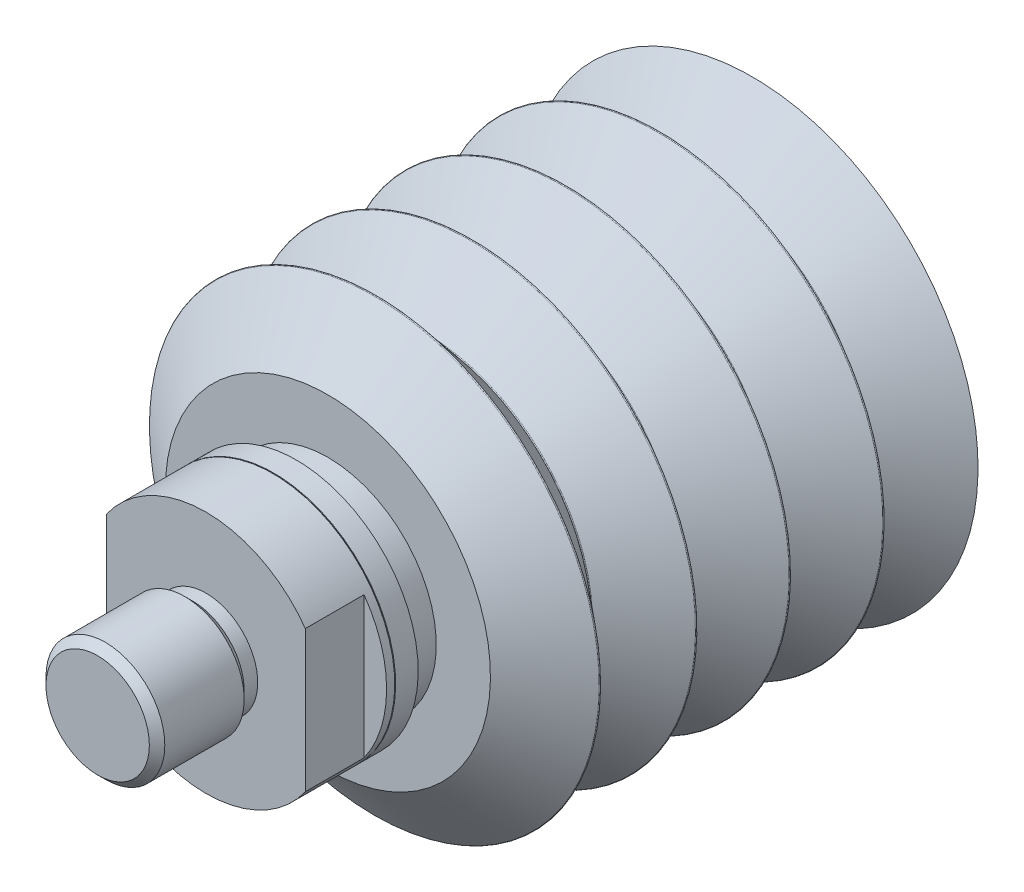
ISO-10303-21;
HEADER;
FILE_DESCRIPTION(('STEP AP214'),'2;1');
FILE_NAME('part.step','',(''),(''),'','','');
FILE_SCHEMA(('AUTOMOTIVE_DESIGN { 1 0 10303 214 1 1 1 1 }'));
ENDSEC;
DATA;
#1=APPLICATION_CONTEXT('core data for automotive mechanical design processes');
#2=APPLICATION_PROTOCOL_DEFINITION('international standard','automotive_design',2000,#1);
#3=PRODUCT_CONTEXT('',#1,'mechanical');
#4=PRODUCT('Part','Part','',(#3));
#5=PRODUCT_RELATED_PRODUCT_CATEGORY('part','',(#4));
#6=PRODUCT_DEFINITION_FORMATION('','',#4);
#7=PRODUCT_DEFINITION_CONTEXT('part definition',#1,'design');
#8=PRODUCT_DEFINITION('design','',#6,#7);
#9=PRODUCT_DEFINITION_SHAPE('','',#8);
#10=(LENGTH_UNIT() NAMED_UNIT(*) SI_UNIT(.MILLI.,.METRE.));
#11=(NAMED_UNIT(*) PLANE_ANGLE_UNIT() SI_UNIT($,.RADIAN.));
#12=(NAMED_UNIT(*) SI_UNIT($,.STERADIAN.) SOLID_ANGLE_UNIT());
#13=UNCERTAINTY_MEASURE_WITH_UNIT(LENGTH_MEASURE(1.E-05),#10,'distance_accuracy_value','');
#14=(GEOMETRIC_REPRESENTATION_CONTEXT(3) GLOBAL_UNCERTAINTY_ASSIGNED_CONTEXT((#13)) GLOBAL_UNIT_ASSIGNED_CONTEXT((#10,
#11,#12)) REPRESENTATION_CONTEXT('',''));
#15=CARTESIAN_POINT('',(0.,0.,0.));
#16=DIRECTION('',(0.,0.,1.));
#17=DIRECTION('',(1.,0.,0.));
#18=AXIS2_PLACEMENT_3D('',#15,#16,#17);
#19=CARTESIAN_POINT('',(0.,0.,53.));
#20=DIRECTION('',(0.,0.,-1.));
#21=DIRECTION('',(0.,-1.,0.));
#22=AXIS2_PLACEMENT_3D('',#19,#20,#21);
#23=CYLINDRICAL_SURFACE('',#22,2.);
#24=CARTESIAN_POINT('',(0.,0.,53.));
#25=DIRECTION('',(0.,0.,-1.));
#26=DIRECTION('',(0.,-1.,0.));
#27=AXIS2_PLACEMENT_3D('',#24,#25,#26);
#28=CIRCLE('',#27,2.);
#29=CARTESIAN_POINT('',(0.,-2.,53.));
#30=VERTEX_POINT('',#29);
#31=EDGE_CURVE('E336',#30,#30,#28,.T.);
#32=ORIENTED_EDGE('',*,*,#31,.T.);
#33=EDGE_LOOP('',(#32));
#34=FACE_BOUND('',#33,.T.);
#35=CARTESIAN_POINT('',(0.,0.,60.5));
#36=DIRECTION('',(0.,0.,1.));
#37=DIRECTION('',(1.,0.,0.));
#38=AXIS2_PLACEMENT_3D('',#35,#36,#37);
#39=CIRCLE('',#38,2.);
#40=CARTESIAN_POINT('',(2.,0.,60.5));
#41=VERTEX_POINT('',#40);
#42=EDGE_CURVE('E439',#41,#41,#39,.F.);
#43=ORIENTED_EDGE('',*,*,#42,.F.);
#44=EDGE_LOOP('',(#43));
#45=FACE_BOUND('',#44,.T.);
#46=ADVANCED_FACE('F16',(#34,#45),#23,.F.);
#47=CARTESIAN_POINT('',(11.,-14.,61.5));
#48=DIRECTION('',(-1.,0.,0.));
#49=DIRECTION('',(0.,0.,1.));
#50=AXIS2_PLACEMENT_3D('',#47,#48,#49);
#51=PLANE('',#50);
#52=DIRECTION('',(0.,0.,1.));
#53=VECTOR('',#52,1.);
#54=CARTESIAN_POINT('',(11.,7.82623792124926,53.));
#55=LINE('',#54,#53);
#56=CARTESIAN_POINT('',(11.,7.82623792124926,54.));
#57=VERTEX_POINT('',#56);
#58=CARTESIAN_POINT('',(11.,7.82623792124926,60.5));
#59=VERTEX_POINT('',#58);
#60=EDGE_CURVE('E307',#57,#59,#55,.T.);
#61=ORIENTED_EDGE('',*,*,#60,.T.);
#62=DIRECTION('',(0.,-1.,0.));
#63=VECTOR('',#62,1.);
#64=CARTESIAN_POINT('',(11.,0.,60.5));
#65=LINE('',#64,#63);
#66=CARTESIAN_POINT('',(11.,-7.82623792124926,60.5));
#67=VERTEX_POINT('',#66);
#68=EDGE_CURVE('E40',#59,#67,#65,.T.);
#69=ORIENTED_EDGE('',*,*,#68,.T.);
#70=DIRECTION('',(0.,0.,-1.));
#71=VECTOR('',#70,1.);
#72=CARTESIAN_POINT('',(11.,-7.82623792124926,53.));
#73=LINE('',#72,#71);
#74=CARTESIAN_POINT('',(11.,-7.82623792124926,54.));
#75=VERTEX_POINT('',#74);
#76=EDGE_CURVE('E306',#67,#75,#73,.T.);
#77=ORIENTED_EDGE('',*,*,#76,.T.);
#78=DIRECTION('',(0.,1.,0.));
#79=VECTOR('',#78,1.);
#80=CARTESIAN_POINT('',(11.,-14.,54.));
#81=LINE('',#80,#79);
#82=EDGE_CURVE('E364',#75,#57,#81,.T.);
#83=ORIENTED_EDGE('',*,*,#82,.T.);
#84=EDGE_LOOP('',(#61,#69,#77,#83));
#85=FACE_BOUND('',#84,.T.);
#86=ADVANCED_FACE('F461',(#85),#51,.F.);
#87=CARTESIAN_POINT('',(0.,0.,54.));
#88=DIRECTION('',(0.,0.,1.));
#89=DIRECTION('',(-1.,0.,0.));
#90=AXIS2_PLACEMENT_3D('',#87,#88,#89);
#91=PLANE('',#90);
#92=ORIENTED_EDGE('',*,*,#82,.F.);
#93=CARTESIAN_POINT('',(0.,0.,54.));
#94=DIRECTION('',(0.,0.,-1.));
#95=DIRECTION('',(0.,1.,0.));
#96=AXIS2_PLACEMENT_3D('',#93,#94,#95);
#97=CIRCLE('',#96,13.5);
#98=EDGE_CURVE('E302',#57,#75,#97,.T.);
#99=ORIENTED_EDGE('',*,*,#98,.F.);
#100=EDGE_LOOP('',(#92,#99));
#101=FACE_BOUND('',#100,.T.);
#102=ADVANCED_FACE('F467',(#101),#91,.T.);
#103=CARTESIAN_POINT('',(0.,0.,54.));
#104=DIRECTION('',(0.,0.,1.));
#105=DIRECTION('',(-1.,0.,0.));
#106=AXIS2_PLACEMENT_3D('',#103,#104,#105);
#107=PLANE('',#106);
#108=DIRECTION('',(0.,-1.,0.));
#109=VECTOR('',#108,1.);
#110=CARTESIAN_POINT('',(-11.,14.,54.));
#111=LINE('',#110,#109);
#112=CARTESIAN_POINT('',(-11.,7.82623792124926,54.));
#113=VERTEX_POINT('',#112);
#114=CARTESIAN_POINT('',(-11.,-7.82623792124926,54.));
#115=VERTEX_POINT('',#114);
#116=EDGE_CURVE('E235',#113,#115,#111,.T.);
#117=ORIENTED_EDGE('',*,*,#116,.F.);
#118=CARTESIAN_POINT('',(0.,0.,54.));
#119=DIRECTION('',(0.,0.,-1.));
#120=DIRECTION('',(0.,1.,0.));
#121=AXIS2_PLACEMENT_3D('',#118,#119,#120);
#122=CIRCLE('',#121,13.5);
#123=EDGE_CURVE('E313',#115,#113,#122,.T.);
#124=ORIENTED_EDGE('',*,*,#123,.F.);
#125=EDGE_LOOP('',(#117,#124));
#126=FACE_BOUND('',#125,.T.);
#127=ADVANCED_FACE('F563',(#126),#107,.T.);
#128=CARTESIAN_POINT('',(-11.,14.,61.5));
#129=DIRECTION('',(1.,0.,0.));
#130=DIRECTION('',(0.,1.,0.));
#131=AXIS2_PLACEMENT_3D('',#128,#129,#130);
#132=PLANE('',#131);
#133=DIRECTION('',(0.,0.,1.));
#134=VECTOR('',#133,1.);
#135=CARTESIAN_POINT('',(-11.,-7.82623792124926,53.));
#136=LINE('',#135,#134);
#137=CARTESIAN_POINT('',(-11.,-7.82623792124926,60.5));
#138=VERTEX_POINT('',#137);
#139=EDGE_CURVE('E318',#115,#138,#136,.T.);
#140=ORIENTED_EDGE('',*,*,#139,.T.);
#141=DIRECTION('',(0.,1.,0.));
#142=VECTOR('',#141,1.);
#143=CARTESIAN_POINT('',(-11.,0.,60.5));
#144=LINE('',#143,#142);
#145=CARTESIAN_POINT('',(-11.,7.82623792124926,60.5));
#146=VERTEX_POINT('',#145);
#147=EDGE_CURVE('E224',#138,#146,#144,.T.);
#148=ORIENTED_EDGE('',*,*,#147,.T.);
#149=DIRECTION('',(0.,0.,-1.));
#150=VECTOR('',#149,1.);
#151=CARTESIAN_POINT('',(-11.,7.82623792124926,53.));
#152=LINE('',#151,#150);
#153=EDGE_CURVE('E317',#146,#113,#152,.T.);
#154=ORIENTED_EDGE('',*,*,#153,.T.);
#155=ORIENTED_EDGE('',*,*,#116,.T.);
#156=EDGE_LOOP('',(#140,#148,#154,#155));
#157=FACE_BOUND('',#156,.T.);
#158=ADVANCED_FACE('F542',(#157),#132,.F.);
#159=CARTESIAN_POINT('',(-13.5,0.,60.5));
#160=DIRECTION('',(0.,0.,1.));
#161=DIRECTION('',(-1.,0.,0.));
#162=AXIS2_PLACEMENT_3D('',#159,#160,#161);
#163=PLANE('',#162);
#164=CARTESIAN_POINT('',(0.,0.,60.5));
#165=DIRECTION('',(0.,0.,-1.));
#166=DIRECTION('',(-1.,0.,0.));
#167=AXIS2_PLACEMENT_3D('',#164,#165,#166);
#168=CIRCLE('',#167,5.725);
#169=CARTESIAN_POINT('',(-5.725,0.,60.5));
#170=VERTEX_POINT('',#169);
#171=EDGE_CURVE('E1309',#170,#170,#168,.T.);
#172=ORIENTED_EDGE('',*,*,#171,.T.);
#173=EDGE_LOOP('',(#172));
#174=FACE_BOUND('',#173,.T.);
#175=ORIENTED_EDGE('',*,*,#68,.F.);
#176=CARTESIAN_POINT('',(0.,0.,60.5));
#177=DIRECTION('',(0.,0.,-1.));
#178=DIRECTION('',(0.,-1.,0.));
#179=AXIS2_PLACEMENT_3D('',#176,#177,#178);
#180=CIRCLE('',#179,13.5);
#181=EDGE_CURVE('E382',#146,#59,#180,.T.);
#182=ORIENTED_EDGE('',*,*,#181,.F.);
#183=ORIENTED_EDGE('',*,*,#147,.F.);
#184=CARTESIAN_POINT('',(0.,0.,60.5));
#185=DIRECTION('',(0.,0.,-1.));
#186=DIRECTION('',(0.,-1.,0.));
#187=AXIS2_PLACEMENT_3D('',#184,#185,#186);
#188=CIRCLE('',#187,13.5);
#189=EDGE_CURVE('E343',#67,#138,#188,.T.);
#190=ORIENTED_EDGE('',*,*,#189,.F.);
#191=EDGE_LOOP('',(#175,#182,#183,#190));
#192=FACE_BOUND('',#191,.T.);
#193=ADVANCED_FACE('F538',(#174,#192),#163,.T.);
#194=CARTESIAN_POINT('',(0.,0.,53.));
#195=DIRECTION('',(0.,0.,-1.));
#196=DIRECTION('',(0.,-1.,0.));
#197=AXIS2_PLACEMENT_3D('',#194,#195,#196);
#198=CYLINDRICAL_SURFACE('',#197,13.5);
#199=CARTESIAN_POINT('',(0.,0.,53.1));
#200=DIRECTION('',(0.,0.,-1.));
#201=DIRECTION('',(0.,-1.,0.));
#202=AXIS2_PLACEMENT_3D('',#199,#200,#201);
#203=CIRCLE('',#202,13.5);
#204=CARTESIAN_POINT('',(0.,-13.5,53.1));
#205=VERTEX_POINT('',#204);
#206=EDGE_CURVE('E339',#205,#205,#203,.T.);
#207=ORIENTED_EDGE('',*,*,#206,.F.);
#208=EDGE_LOOP('',(#207));
#209=FACE_BOUND('',#208,.T.);
#210=ORIENTED_EDGE('',*,*,#139,.F.);
#211=ORIENTED_EDGE('',*,*,#123,.T.);
#212=ORIENTED_EDGE('',*,*,#153,.F.);
#213=ORIENTED_EDGE('',*,*,#181,.T.);
#214=ORIENTED_EDGE('',*,*,#60,.F.);
#215=ORIENTED_EDGE('',*,*,#98,.T.);
#216=ORIENTED_EDGE('',*,*,#76,.F.);
#217=ORIENTED_EDGE('',*,*,#189,.T.);
#218=EDGE_LOOP('',(#210,#211,#212,#213,#214,#215,#216,#217));
#219=FACE_BOUND('',#218,.T.);
#220=ADVANCED_FACE('F541',(#209,#219),#198,.T.);
#221=CARTESIAN_POINT('',(0.,0.,53.));
#222=DIRECTION('',(0.,0.,1.));
#223=DIRECTION('',(0.,1.,0.));
#224=AXIS2_PLACEMENT_3D('',#221,#222,#223);
#225=CONICAL_SURFACE('',#224,13.4,0.785398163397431);
#226=CARTESIAN_POINT('',(0.,0.,53.));
#227=DIRECTION('',(0.,0.,-1.));
#228=DIRECTION('',(0.,-1.,0.));
#229=AXIS2_PLACEMENT_3D('',#226,#227,#228);
#230=CIRCLE('',#229,13.4);
#231=CARTESIAN_POINT('',(0.,-13.4,53.));
#232=VERTEX_POINT('',#231);
#233=EDGE_CURVE('E377',#232,#232,#230,.T.);
#234=ORIENTED_EDGE('',*,*,#233,.F.);
#235=EDGE_LOOP('',(#234));
#236=FACE_BOUND('',#235,.T.);
#237=ORIENTED_EDGE('',*,*,#206,.T.);
#238=EDGE_LOOP('',(#237));
#239=FACE_BOUND('',#238,.T.);
#240=ADVANCED_FACE('F588',(#236,#239),#225,.T.);
#241=CARTESIAN_POINT('',(-2.,0.,53.));
#242=DIRECTION('',(0.,0.,-1.));
#243=DIRECTION('',(0.,-1.,0.));
#244=AXIS2_PLACEMENT_3D('',#241,#242,#243);
#245=PLANE('',#244);
#246=ORIENTED_EDGE('',*,*,#31,.F.);
#247=EDGE_LOOP('',(#246));
#248=FACE_BOUND('',#247,.T.);
#249=CARTESIAN_POINT('',(0.,0.,53.));
#250=DIRECTION('',(0.,0.,-1.));
#251=DIRECTION('',(0.,-1.,0.));
#252=AXIS2_PLACEMENT_3D('',#249,#250,#251);
#253=CIRCLE('',#252,5.25);
#254=CARTESIAN_POINT('',(0.,-5.25,53.));
#255=VERTEX_POINT('',#254);
#256=EDGE_CURVE('E340',#255,#255,#253,.T.);
#257=ORIENTED_EDGE('',*,*,#256,.T.);
#258=EDGE_LOOP('',(#257));
#259=FACE_BOUND('',#258,.T.);
#260=ADVANCED_FACE('F571',(#248,#259),#245,.T.);
#261=CARTESIAN_POINT('',(0.,0.,0.));
#262=DIRECTION('',(0.,0.,-1.));
#263=DIRECTION('',(0.,-1.,0.));
#264=AXIS2_PLACEMENT_3D('',#261,#262,#263);
#265=CYLINDRICAL_SURFACE('',#264,5.25);
#266=ORIENTED_EDGE('',*,*,#256,.F.);
#267=EDGE_LOOP('',(#266));
#268=FACE_BOUND('',#267,.T.);
#269=CARTESIAN_POINT('',(0.,0.,50.5));
#270=DIRECTION('',(0.,0.,-1.));
#271=DIRECTION('',(0.,-1.,0.));
#272=AXIS2_PLACEMENT_3D('',#269,#270,#271);
#273=CIRCLE('',#272,5.25);
#274=CARTESIAN_POINT('',(0.,-5.25,50.5));
#275=VERTEX_POINT('',#274);
#276=EDGE_CURVE('E322',#275,#275,#273,.T.);
#277=ORIENTED_EDGE('',*,*,#276,.T.);
#278=EDGE_LOOP('',(#277));
#279=FACE_BOUND('',#278,.T.);
#280=ADVANCED_FACE('F567',(#268,#279),#265,.F.);
#281=CARTESIAN_POINT('',(-13.5,0.,53.));
#282=DIRECTION('',(0.,0.,1.));
#283=DIRECTION('',(-1.,0.,0.));
#284=AXIS2_PLACEMENT_3D('',#281,#282,#283);
#285=PLANE('',#284);
#286=CARTESIAN_POINT('',(0.,0.,53.));
#287=DIRECTION('',(0.,0.,-1.));
#288=DIRECTION('',(0.,-1.,0.));
#289=AXIS2_PLACEMENT_3D('',#286,#287,#288);
#290=CIRCLE('',#289,13.5);
#291=CARTESIAN_POINT('',(0.,-13.5,53.));
#292=VERTEX_POINT('',#291);
#293=EDGE_CURVE('E300',#292,#292,#290,.T.);
#294=ORIENTED_EDGE('',*,*,#293,.F.);
#295=EDGE_LOOP('',(#294));
#296=FACE_BOUND('',#295,.T.);
#297=ORIENTED_EDGE('',*,*,#233,.T.);
#298=EDGE_LOOP('',(#297));
#299=FACE_BOUND('',#298,.T.);
#300=ADVANCED_FACE('F570',(#296,#299),#285,.T.);
#301=CARTESIAN_POINT('',(0.,0.,0.));
#302=DIRECTION('',(0.,0.,-1.));
#303=DIRECTION('',(0.,-1.,0.));
#304=AXIS2_PLACEMENT_3D('',#301,#302,#303);
#305=CYLINDRICAL_SURFACE('',#304,13.5);
#306=CARTESIAN_POINT('',(0.,0.,50.5));
#307=DIRECTION('',(0.,0.,-1.));
#308=DIRECTION('',(0.,-1.,0.));
#309=AXIS2_PLACEMENT_3D('',#306,#307,#308);
#310=CIRCLE('',#309,13.5);
#311=CARTESIAN_POINT('',(0.,-13.5,50.5));
#312=VERTEX_POINT('',#311);
#313=EDGE_CURVE('E296',#312,#312,#310,.T.);
#314=ORIENTED_EDGE('',*,*,#313,.F.);
#315=EDGE_LOOP('',(#314));
#316=FACE_BOUND('',#315,.T.);
#317=ORIENTED_EDGE('',*,*,#293,.T.);
#318=EDGE_LOOP('',(#317));
#319=FACE_BOUND('',#318,.T.);
#320=ADVANCED_FACE('F606',(#316,#319),#305,.T.);
#321=CARTESIAN_POINT('',(-12.,0.,50.5));
#322=DIRECTION('',(0.,0.,-1.));
#323=DIRECTION('',(0.,-1.,0.));
#324=AXIS2_PLACEMENT_3D('',#321,#322,#323);
#325=PLANE('',#324);
#326=CARTESIAN_POINT('',(0.,0.,50.5));
#327=DIRECTION('',(0.,0.,-1.));
#328=DIRECTION('',(0.,-1.,0.));
#329=AXIS2_PLACEMENT_3D('',#326,#327,#328);
#330=CIRCLE('',#329,12.);
#331=CARTESIAN_POINT('',(0.,-12.,50.5));
#332=VERTEX_POINT('',#331);
#333=EDGE_CURVE('E301',#332,#332,#330,.T.);
#334=ORIENTED_EDGE('',*,*,#333,.F.);
#335=EDGE_LOOP('',(#334));
#336=FACE_BOUND('',#335,.T.);
#337=ORIENTED_EDGE('',*,*,#313,.T.);
#338=EDGE_LOOP('',(#337));
#339=FACE_BOUND('',#338,.T.);
#340=ADVANCED_FACE('F557',(#336,#339),#325,.T.);
#341=CARTESIAN_POINT('',(0.,0.,0.));
#342=DIRECTION('',(0.,0.,-1.));
#343=DIRECTION('',(0.,-1.,0.));
#344=AXIS2_PLACEMENT_3D('',#341,#342,#343);
#345=CYLINDRICAL_SURFACE('',#344,12.);
#346=CARTESIAN_POINT('',(0.,0.,47.));
#347=DIRECTION('',(0.,0.,-1.));
#348=DIRECTION('',(0.,-1.,0.));
#349=AXIS2_PLACEMENT_3D('',#346,#347,#348);
#350=CIRCLE('',#349,12.);
#351=CARTESIAN_POINT('',(0.,-12.,47.));
#352=VERTEX_POINT('',#351);
#353=EDGE_CURVE('E345',#352,#352,#350,.T.);
#354=ORIENTED_EDGE('',*,*,#353,.F.);
#355=EDGE_LOOP('',(#354));
#356=FACE_BOUND('',#355,.T.);
#357=ORIENTED_EDGE('',*,*,#333,.T.);
#358=EDGE_LOOP('',(#357));
#359=FACE_BOUND('',#358,.T.);
#360=ADVANCED_FACE('F553',(#356,#359),#345,.T.);
#361=CARTESIAN_POINT('',(-18.,0.,47.));
#362=DIRECTION('',(0.,0.,1.));
#363=DIRECTION('',(-1.,0.,0.));
#364=AXIS2_PLACEMENT_3D('',#361,#362,#363);
#365=PLANE('',#364);
#366=CARTESIAN_POINT('',(0.,0.,47.));
#367=DIRECTION('',(0.,0.,-1.));
#368=DIRECTION('',(0.,-1.,0.));
#369=AXIS2_PLACEMENT_3D('',#366,#367,#368);
#370=CIRCLE('',#369,18.);
#371=CARTESIAN_POINT('',(0.,-18.,47.));
#372=VERTEX_POINT('',#371);
#373=EDGE_CURVE('E349',#372,#372,#370,.T.);
#374=ORIENTED_EDGE('',*,*,#373,.F.);
#375=EDGE_LOOP('',(#374));
#376=FACE_BOUND('',#375,.T.);
#377=ORIENTED_EDGE('',*,*,#353,.T.);
#378=EDGE_LOOP('',(#377));
#379=FACE_BOUND('',#378,.T.);
#380=ADVANCED_FACE('F556',(#376,#379),#365,.T.);
#381=CARTESIAN_POINT('',(0.,0.,41.8675539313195));
#382=DIRECTION('',(0.,0.,-1.));
#383=DIRECTION('',(0.,-1.,0.));
#384=AXIS2_PLACEMENT_3D('',#381,#382,#383);
#385=CONICAL_SURFACE('',#384,24.8984996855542,0.931149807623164);
#386=CARTESIAN_POINT('',(0.,0.,41.8675539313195));
#387=DIRECTION('',(0.,0.,-1.));
#388=DIRECTION('',(0.,-1.,0.));
#389=AXIS2_PLACEMENT_3D('',#386,#387,#388);
#390=CIRCLE('',#389,24.8984996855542);
#391=CARTESIAN_POINT('',(0.,-24.8984996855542,41.8675539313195));
#392=VERTEX_POINT('',#391);
#393=EDGE_CURVE('E405',#392,#392,#390,.T.);
#394=ORIENTED_EDGE('',*,*,#393,.F.);
#395=EDGE_LOOP('',(#394));
#396=FACE_BOUND('',#395,.T.);
#397=ORIENTED_EDGE('',*,*,#373,.T.);
#398=EDGE_LOOP('',(#397));
#399=FACE_BOUND('',#398,.T.);
#400=ADVANCED_FACE('F643',(#396,#399),#385,.T.);
#401=CARTESIAN_POINT('',(0.,0.,41.7873232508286));
#402=DIRECTION('',(0.,0.,-1.));
#403=DIRECTION('',(0.,-1.,0.));
#404=AXIS2_PLACEMENT_3D('',#401,#402,#403);
#405=TOROIDAL_SURFACE('',#404,24.8388084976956,0.100000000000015);
#406=CARTESIAN_POINT('',(0.,0.,41.7107188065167));
#407=DIRECTION('',(0.,0.,-1.));
#408=DIRECTION('',(0.,-1.,0.));
#409=AXIS2_PLACEMENT_3D('',#406,#407,#408);
#410=CIRCLE('',#409,24.9030872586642);
#411=CARTESIAN_POINT('',(0.,-24.9030872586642,41.7107188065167));
#412=VERTEX_POINT('',#411);
#413=EDGE_CURVE('E406',#412,#412,#410,.T.);
#414=ORIENTED_EDGE('',*,*,#413,.F.);
#415=EDGE_LOOP('',(#414));
#416=FACE_BOUND('',#415,.T.);
#417=ORIENTED_EDGE('',*,*,#393,.T.);
#418=EDGE_LOOP('',(#417));
#419=FACE_BOUND('',#418,.T.);
#420=ADVANCED_FACE('F501',(#416,#419),#405,.T.);
#421=CARTESIAN_POINT('',(0.,0.,36.3405360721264));
#422=DIRECTION('',(0.,0.,1.));
#423=DIRECTION('',(0.,1.,0.));
#424=AXIS2_PLACEMENT_3D('',#421,#422,#423);
#425=CONICAL_SURFACE('',#424,18.5031526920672,0.872664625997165);
#426=CARTESIAN_POINT('',(0.,0.,36.3405360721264));
#427=DIRECTION('',(0.,0.,-1.));
#428=DIRECTION('',(0.,-1.,0.));
#429=AXIS2_PLACEMENT_3D('',#426,#427,#428);
#430=CIRCLE('',#429,18.5031526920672);
#431=CARTESIAN_POINT('',(0.,-18.5031526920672,36.3405360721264));
#432=VERTEX_POINT('',#431);
#433=EDGE_CURVE('E399',#432,#432,#430,.T.);
#434=ORIENTED_EDGE('',*,*,#433,.F.);
#435=EDGE_LOOP('',(#434));
#436=FACE_BOUND('',#435,.T.);
#437=ORIENTED_EDGE('',*,*,#413,.T.);
#438=EDGE_LOOP('',(#437));
#439=FACE_BOUND('',#438,.T.);
#440=ADVANCED_FACE('F495',(#436,#439),#425,.T.);
#441=CARTESIAN_POINT('',(0.,0.,36.2639316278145));
#442=DIRECTION('',(0.,0.,-1.));
#443=DIRECTION('',(0.,-1.,0.));
#444=AXIS2_PLACEMENT_3D('',#441,#442,#443);
#445=TOROIDAL_SURFACE('',#444,18.5674314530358,0.0999999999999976);
#446=ORIENTED_EDGE('',*,*,#433,.T.);
#447=EDGE_LOOP('',(#446));
#448=FACE_BOUND('',#447,.T.);
#449=CARTESIAN_POINT('',(0.,0.,36.1851305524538));
#450=DIRECTION('',(0.,0.,-1.));
#451=DIRECTION('',(0.,-1.,0.));
#452=AXIS2_PLACEMENT_3D('',#449,#450,#451);
#453=CIRCLE('',#452,18.5058653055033);
#454=CARTESIAN_POINT('',(0.,-18.5058653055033,36.1851305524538));
#455=VERTEX_POINT('',#454);
#456=EDGE_CURVE('E335',#455,#455,#453,.T.);
#457=ORIENTED_EDGE('',*,*,#456,.F.);
#458=EDGE_LOOP('',(#457));
#459=FACE_BOUND('',#458,.T.);
#460=ADVANCED_FACE('F485',(#448,#459),#445,.F.);
#461=CARTESIAN_POINT('',(0.,0.,31.1945583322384));
#462=DIRECTION('',(0.,0.,-1.));
#463=DIRECTION('',(0.,-1.,0.));
#464=AXIS2_PLACEMENT_3D('',#461,#462,#463);
#465=CONICAL_SURFACE('',#464,24.8935064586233,0.907571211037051);
#466=CARTESIAN_POINT('',(0.,0.,31.1945583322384));
#467=DIRECTION('',(0.,0.,-1.));
#468=DIRECTION('',(0.,-1.,0.));
#469=AXIS2_PLACEMENT_3D('',#466,#467,#468);
#470=CIRCLE('',#469,24.8935064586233);
#471=CARTESIAN_POINT('',(0.,-24.8935064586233,31.1945583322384));
#472=VERTEX_POINT('',#471);
#473=EDGE_CURVE('E332',#472,#472,#470,.T.);
#474=ORIENTED_EDGE('',*,*,#473,.F.);
#475=EDGE_LOOP('',(#474));
#476=FACE_BOUND('',#475,.T.);
#477=ORIENTED_EDGE('',*,*,#456,.T.);
#478=EDGE_LOOP('',(#477));
#479=FACE_BOUND('',#478,.T.);
#480=ADVANCED_FACE('F476',(#476,#479),#465,.T.);
#481=CARTESIAN_POINT('',(0.,0.,31.1157572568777));
#482=DIRECTION('',(0.,0.,-1.));
#483=DIRECTION('',(0.,-1.,0.));
#484=AXIS2_PLACEMENT_3D('',#481,#482,#483);
#485=TOROIDAL_SURFACE('',#484,24.8319403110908,0.1);
#486=CARTESIAN_POINT('',(0.,0.,31.0338420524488));
#487=DIRECTION('',(0.,0.,-1.));
#488=DIRECTION('',(0.,-1.,0.));
#489=AXIS2_PLACEMENT_3D('',#486,#487,#488);
#490=CIRCLE('',#489,24.8892979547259);
#491=CARTESIAN_POINT('',(0.,-24.8892979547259,31.0338420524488));
#492=VERTEX_POINT('',#491);
#493=EDGE_CURVE('E294',#492,#492,#490,.T.);
#494=ORIENTED_EDGE('',*,*,#493,.F.);
#495=EDGE_LOOP('',(#494));
#496=FACE_BOUND('',#495,.T.);
#497=ORIENTED_EDGE('',*,*,#473,.T.);
#498=EDGE_LOOP('',(#497));
#499=FACE_BOUND('',#498,.T.);
#500=ADVANCED_FACE('F473',(#496,#499),#485,.T.);
#501=CARTESIAN_POINT('',(0.,0.,26.2874180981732));
#502=DIRECTION('',(0.,0.,1.));
#503=DIRECTION('',(0.,1.,0.));
#504=AXIS2_PLACEMENT_3D('',#501,#502,#503);
#505=CONICAL_SURFACE('',#504,18.1107020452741,0.959931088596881);
#506=CARTESIAN_POINT('',(0.,0.,26.2874180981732));
#507=DIRECTION('',(0.,0.,-1.));
#508=DIRECTION('',(0.,-1.,0.));
#509=AXIS2_PLACEMENT_3D('',#506,#507,#508);
#510=CIRCLE('',#509,18.1107020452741);
#511=CARTESIAN_POINT('',(0.,-18.1107020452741,26.2874180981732));
#512=VERTEX_POINT('',#511);
#513=EDGE_CURVE('E354',#512,#512,#510,.T.);
#514=ORIENTED_EDGE('',*,*,#513,.F.);
#515=EDGE_LOOP('',(#514));
#516=FACE_BOUND('',#515,.T.);
#517=ORIENTED_EDGE('',*,*,#493,.T.);
#518=EDGE_LOOP('',(#517));
#519=FACE_BOUND('',#518,.T.);
#520=ADVANCED_FACE('F475',(#516,#519),#505,.T.);
#521=CARTESIAN_POINT('',(0.,0.,26.2055028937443));
#522=DIRECTION('',(0.,0.,-1.));
#523=DIRECTION('',(0.,-1.,0.));
#524=AXIS2_PLACEMENT_3D('',#521,#522,#523);
#525=TOROIDAL_SURFACE('',#524,18.1680596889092,0.0999999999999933);
#526=ORIENTED_EDGE('',*,*,#513,.T.);
#527=EDGE_LOOP('',(#526));
#528=FACE_BOUND('',#527,.T.);
#529=CARTESIAN_POINT('',(0.,0.,26.1267018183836));
#530=DIRECTION('',(0.,0.,-1.));
#531=DIRECTION('',(0.,-1.,0.));
#532=AXIS2_PLACEMENT_3D('',#529,#530,#531);
#533=CIRCLE('',#532,18.1064935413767);
#534=CARTESIAN_POINT('',(0.,-18.1064935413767,26.1267018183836));
#535=VERTEX_POINT('',#534);
#536=EDGE_CURVE('E287',#535,#535,#533,.T.);
#537=ORIENTED_EDGE('',*,*,#536,.F.);
#538=EDGE_LOOP('',(#537));
#539=FACE_BOUND('',#538,.T.);
#540=ADVANCED_FACE('F482',(#528,#539),#525,.F.);
#541=CARTESIAN_POINT('',(0.,0.,20.8241061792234));
#542=DIRECTION('',(0.,0.,-1.));
#543=DIRECTION('',(0.,-1.,0.));
#544=AXIS2_PLACEMENT_3D('',#541,#542,#543);
#545=CONICAL_SURFACE('',#544,24.8935064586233,0.907571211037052);
#546=CARTESIAN_POINT('',(0.,0.,20.8241061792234));
#547=DIRECTION('',(0.,0.,-1.));
#548=DIRECTION('',(0.,-1.,0.));
#549=AXIS2_PLACEMENT_3D('',#546,#547,#548);
#550=CIRCLE('',#549,24.8935064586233);
#551=CARTESIAN_POINT('',(0.,-24.8935064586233,20.8241061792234));
#552=VERTEX_POINT('',#551);
#553=EDGE_CURVE('E279',#552,#552,#550,.T.);
#554=ORIENTED_EDGE('',*,*,#553,.F.);
#555=EDGE_LOOP('',(#554));
#556=FACE_BOUND('',#555,.T.);
#557=ORIENTED_EDGE('',*,*,#536,.T.);
#558=EDGE_LOOP('',(#557));
#559=FACE_BOUND('',#558,.T.);
#560=ADVANCED_FACE('F582',(#556,#559),#545,.T.);
#561=CARTESIAN_POINT('',(0.,0.,20.7453051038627));
#562=DIRECTION('',(0.,0.,-1.));
#563=DIRECTION('',(0.,-1.,0.));
#564=AXIS2_PLACEMENT_3D('',#561,#562,#563);
#565=TOROIDAL_SURFACE('',#564,24.8319403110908,0.100000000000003);
#566=CARTESIAN_POINT('',(0.,0.,20.6633898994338));
#567=DIRECTION('',(0.,0.,-1.));
#568=DIRECTION('',(0.,-1.,0.));
#569=AXIS2_PLACEMENT_3D('',#566,#567,#568);
#570=CIRCLE('',#569,24.8892979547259);
#571=CARTESIAN_POINT('',(0.,-24.8892979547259,20.6633898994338));
#572=VERTEX_POINT('',#571);
#573=EDGE_CURVE('E275',#572,#572,#570,.T.);
#574=ORIENTED_EDGE('',*,*,#573,.F.);
#575=EDGE_LOOP('',(#574));
#576=FACE_BOUND('',#575,.T.);
#577=ORIENTED_EDGE('',*,*,#553,.T.);
#578=EDGE_LOOP('',(#577));
#579=FACE_BOUND('',#578,.T.);
#580=ADVANCED_FACE('F530',(#576,#579),#565,.T.);
#581=CARTESIAN_POINT('',(0.,0.,15.9169659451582));
#582=DIRECTION('',(0.,0.,1.));
#583=DIRECTION('',(0.,1.,0.));
#584=AXIS2_PLACEMENT_3D('',#581,#582,#583);
#585=CONICAL_SURFACE('',#584,18.1107020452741,0.959931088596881);
#586=CARTESIAN_POINT('',(0.,0.,15.9169659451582));
#587=DIRECTION('',(0.,0.,-1.));
#588=DIRECTION('',(0.,-1.,0.));
#589=AXIS2_PLACEMENT_3D('',#586,#587,#588);
#590=CIRCLE('',#589,18.1107020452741);
#591=CARTESIAN_POINT('',(0.,-18.1107020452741,15.9169659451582));
#592=VERTEX_POINT('',#591);
#593=EDGE_CURVE('E280',#592,#592,#590,.T.);
#594=ORIENTED_EDGE('',*,*,#593,.F.);
#595=EDGE_LOOP('',(#594));
#596=FACE_BOUND('',#595,.T.);
#597=ORIENTED_EDGE('',*,*,#573,.T.);
#598=EDGE_LOOP('',(#597));
#599=FACE_BOUND('',#598,.T.);
#600=ADVANCED_FACE('F276',(#596,#599),#585,.T.);
#601=CARTESIAN_POINT('',(0.,0.,15.8350507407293));
#602=DIRECTION('',(0.,0.,-1.));
#603=DIRECTION('',(0.,-1.,0.));
#604=AXIS2_PLACEMENT_3D('',#601,#602,#603);
#605=TOROIDAL_SURFACE('',#604,18.1680596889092,0.1);
#606=ORIENTED_EDGE('',*,*,#593,.T.);
#607=EDGE_LOOP('',(#606));
#608=FACE_BOUND('',#607,.T.);
#609=CARTESIAN_POINT('',(0.,0.,15.7562496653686));
#610=DIRECTION('',(0.,0.,-1.));
#611=DIRECTION('',(0.,-1.,0.));
#612=AXIS2_PLACEMENT_3D('',#609,#610,#611);
#613=CIRCLE('',#612,18.1064935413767);
#614=CARTESIAN_POINT('',(0.,-18.1064935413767,15.7562496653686));
#615=VERTEX_POINT('',#614);
#616=EDGE_CURVE('E290',#615,#615,#613,.T.);
#617=ORIENTED_EDGE('',*,*,#616,.F.);
#618=EDGE_LOOP('',(#617));
#619=FACE_BOUND('',#618,.T.);
#620=ADVANCED_FACE('F529',(#608,#619),#605,.F.);
#621=CARTESIAN_POINT('',(0.,0.,10.4536540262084));
#622=DIRECTION('',(0.,0.,-1.));
#623=DIRECTION('',(0.,-1.,0.));
#624=AXIS2_PLACEMENT_3D('',#621,#622,#623);
#625=CONICAL_SURFACE('',#624,24.8935064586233,0.907571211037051);
#626=CARTESIAN_POINT('',(0.,0.,10.4536540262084));
#627=DIRECTION('',(0.,0.,-1.));
#628=DIRECTION('',(0.,-1.,0.));
#629=AXIS2_PLACEMENT_3D('',#626,#627,#628);
#630=CIRCLE('',#629,24.8935064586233);
#631=CARTESIAN_POINT('',(0.,-24.8935064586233,10.4536540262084));
#632=VERTEX_POINT('',#631);
#633=EDGE_CURVE('E142',#632,#632,#630,.T.);
#634=ORIENTED_EDGE('',*,*,#633,.F.);
#635=EDGE_LOOP('',(#634));
#636=FACE_BOUND('',#635,.T.);
#637=ORIENTED_EDGE('',*,*,#616,.T.);
#638=EDGE_LOOP('',(#637));
#639=FACE_BOUND('',#638,.T.);
#640=ADVANCED_FACE('F515',(#636,#639),#625,.T.);
#641=CARTESIAN_POINT('',(0.,0.,10.3748529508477));
#642=DIRECTION('',(0.,0.,-1.));
#643=DIRECTION('',(0.,-1.,0.));
#644=AXIS2_PLACEMENT_3D('',#641,#642,#643);
#645=TOROIDAL_SURFACE('',#644,24.8319403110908,0.1);
#646=CARTESIAN_POINT('',(0.,0.,10.2929377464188));
#647=DIRECTION('',(0.,0.,-1.));
#648=DIRECTION('',(0.,-1.,0.));
#649=AXIS2_PLACEMENT_3D('',#646,#647,#648);
#650=CIRCLE('',#649,24.8892979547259);
#651=CARTESIAN_POINT('',(0.,-24.8892979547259,10.2929377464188));
#652=VERTEX_POINT('',#651);
#653=EDGE_CURVE('E155',#652,#652,#650,.T.);
#654=ORIENTED_EDGE('',*,*,#653,.F.);
#655=EDGE_LOOP('',(#654));
#656=FACE_BOUND('',#655,.T.);
#657=ORIENTED_EDGE('',*,*,#633,.T.);
#658=EDGE_LOOP('',(#657));
#659=FACE_BOUND('',#658,.T.);
#660=ADVANCED_FACE('F512',(#656,#659),#645,.T.);
#661=CARTESIAN_POINT('',(0.,0.,5.5465137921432));
#662=DIRECTION('',(0.,0.,1.));
#663=DIRECTION('',(0.,1.,0.));
#664=AXIS2_PLACEMENT_3D('',#661,#662,#663);
#665=CONICAL_SURFACE('',#664,18.1107020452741,0.959931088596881);
#666=CARTESIAN_POINT('',(0.,0.,5.5465137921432));
#667=DIRECTION('',(0.,0.,-1.));
#668=DIRECTION('',(0.,-1.,0.));
#669=AXIS2_PLACEMENT_3D('',#666,#667,#668);
#670=CIRCLE('',#669,18.1107020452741);
#671=CARTESIAN_POINT('',(0.,-18.1107020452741,5.5465137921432));
#672=VERTEX_POINT('',#671);
#673=EDGE_CURVE('E369',#672,#672,#670,.T.);
#674=ORIENTED_EDGE('',*,*,#673,.F.);
#675=EDGE_LOOP('',(#674));
#676=FACE_BOUND('',#675,.T.);
#677=ORIENTED_EDGE('',*,*,#653,.T.);
#678=EDGE_LOOP('',(#677));
#679=FACE_BOUND('',#678,.T.);
#680=ADVANCED_FACE('F514',(#676,#679),#665,.T.);
#681=CARTESIAN_POINT('',(0.,0.,5.4645985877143));
#682=DIRECTION('',(0.,0.,-1.));
#683=DIRECTION('',(0.,-1.,0.));
#684=AXIS2_PLACEMENT_3D('',#681,#682,#683);
#685=TOROIDAL_SURFACE('',#684,18.1680596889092,0.099999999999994);
#686=ORIENTED_EDGE('',*,*,#673,.T.);
#687=EDGE_LOOP('',(#686));
#688=FACE_BOUND('',#687,.T.);
#689=CARTESIAN_POINT('',(0.,0.,5.38579751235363));
#690=DIRECTION('',(0.,0.,-1.));
#691=DIRECTION('',(0.,-1.,0.));
#692=AXIS2_PLACEMENT_3D('',#689,#690,#691);
#693=CIRCLE('',#692,18.1064935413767);
#694=CARTESIAN_POINT('',(0.,-18.1064935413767,5.38579751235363));
#695=VERTEX_POINT('',#694);
#696=EDGE_CURVE('E423',#695,#695,#693,.T.);
#697=ORIENTED_EDGE('',*,*,#696,.F.);
#698=EDGE_LOOP('',(#697));
#699=FACE_BOUND('',#698,.T.);
#700=ADVANCED_FACE('F522',(#688,#699),#685,.F.);
#701=CARTESIAN_POINT('',(0.,0.,0.));
#702=DIRECTION('',(0.,0.,-1.));
#703=DIRECTION('',(0.,-1.,0.));
#704=AXIS2_PLACEMENT_3D('',#701,#702,#703);
#705=CONICAL_SURFACE('',#704,25.,0.907571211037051);
#706=CARTESIAN_POINT('',(0.,0.,0.));
#707=DIRECTION('',(0.,0.,-1.));
#708=DIRECTION('',(0.,-1.,0.));
#709=AXIS2_PLACEMENT_3D('',#706,#707,#708);
#710=CIRCLE('',#709,25.);
#711=CARTESIAN_POINT('',(0.,-25.,0.));
#712=VERTEX_POINT('',#711);
#713=EDGE_CURVE('E416',#712,#712,#710,.T.);
#714=ORIENTED_EDGE('',*,*,#713,.F.);
#715=EDGE_LOOP('',(#714));
#716=FACE_BOUND('',#715,.T.);
#717=ORIENTED_EDGE('',*,*,#696,.T.);
#718=EDGE_LOOP('',(#717));
#719=FACE_BOUND('',#718,.T.);
#720=ADVANCED_FACE('F518',(#716,#719),#705,.T.);
#721=CARTESIAN_POINT('',(-23.9319403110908,0.,0.));
#722=DIRECTION('',(0.,0.,-1.));
#723=DIRECTION('',(0.,-1.,0.));
#724=AXIS2_PLACEMENT_3D('',#721,#722,#723);
#725=PLANE('',#724);
#726=CARTESIAN_POINT('',(0.,0.,0.));
#727=DIRECTION('',(0.,0.,-1.));
#728=DIRECTION('',(0.,-1.,0.));
#729=AXIS2_PLACEMENT_3D('',#726,#727,#728);
#730=CIRCLE('',#729,23.9319403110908);
#731=CARTESIAN_POINT('',(0.,-23.9319403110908,0.));
#732=VERTEX_POINT('',#731);
#733=EDGE_CURVE('E413',#732,#732,#730,.T.);
#734=ORIENTED_EDGE('',*,*,#733,.F.);
#735=EDGE_LOOP('',(#734));
#736=FACE_BOUND('',#735,.T.);
#737=ORIENTED_EDGE('',*,*,#713,.T.);
#738=EDGE_LOOP('',(#737));
#739=FACE_BOUND('',#738,.T.);
#740=ADVANCED_FACE('F521',(#736,#739),#725,.T.);
#741=CARTESIAN_POINT('',(0.,0.,5.38579751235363));
#742=DIRECTION('',(0.,0.,-1.));
#743=DIRECTION('',(0.,-1.,0.));
#744=AXIS2_PLACEMENT_3D('',#741,#742,#743);
#745=CONICAL_SURFACE('',#744,17.0384338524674,0.907571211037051);
#746=CARTESIAN_POINT('',(0.,0.,5.38579751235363));
#747=DIRECTION('',(0.,0.,-1.));
#748=DIRECTION('',(0.,-1.,0.));
#749=AXIS2_PLACEMENT_3D('',#746,#747,#748);
#750=CIRCLE('',#749,17.0384338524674);
#751=CARTESIAN_POINT('',(0.,-17.0384338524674,5.38579751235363));
#752=VERTEX_POINT('',#751);
#753=EDGE_CURVE('E373',#752,#752,#750,.T.);
#754=ORIENTED_EDGE('',*,*,#753,.F.);
#755=EDGE_LOOP('',(#754));
#756=FACE_BOUND('',#755,.T.);
#757=ORIENTED_EDGE('',*,*,#733,.T.);
#758=EDGE_LOOP('',(#757));
#759=FACE_BOUND('',#758,.T.);
#760=ADVANCED_FACE('F548',(#756,#759),#745,.F.);
#761=CARTESIAN_POINT('',(0.,0.,5.46459858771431));
#762=DIRECTION('',(0.,0.,-1.));
#763=DIRECTION('',(0.,-1.,0.));
#764=AXIS2_PLACEMENT_3D('',#761,#762,#763);
#765=TOROIDAL_SURFACE('',#764,17.1,0.100000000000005);
#766=CARTESIAN_POINT('',(0.,0.,5.54651379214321));
#767=DIRECTION('',(0.,0.,-1.));
#768=DIRECTION('',(0.,-1.,0.));
#769=AXIS2_PLACEMENT_3D('',#766,#767,#768);
#770=CIRCLE('',#769,17.0426423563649);
#771=CARTESIAN_POINT('',(0.,-17.0426423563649,5.54651379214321));
#772=VERTEX_POINT('',#771);
#773=EDGE_CURVE('E370',#772,#772,#770,.T.);
#774=ORIENTED_EDGE('',*,*,#773,.F.);
#775=EDGE_LOOP('',(#774));
#776=FACE_BOUND('',#775,.T.);
#777=ORIENTED_EDGE('',*,*,#753,.T.);
#778=EDGE_LOOP('',(#777));
#779=FACE_BOUND('',#778,.T.);
#780=ADVANCED_FACE('F551',(#776,#779),#765,.T.);
#781=CARTESIAN_POINT('',(0.,0.,10.2929377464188));
#782=DIRECTION('',(0.,0.,1.));
#783=DIRECTION('',(0.,1.,0.));
#784=AXIS2_PLACEMENT_3D('',#781,#782,#783);
#785=CONICAL_SURFACE('',#784,23.8212382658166,0.959931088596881);
#786=CARTESIAN_POINT('',(0.,0.,10.2929377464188));
#787=DIRECTION('',(0.,0.,-1.));
#788=DIRECTION('',(0.,-1.,0.));
#789=AXIS2_PLACEMENT_3D('',#786,#787,#788);
#790=CIRCLE('',#789,23.8212382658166);
#791=CARTESIAN_POINT('',(0.,-23.8212382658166,10.2929377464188));
#792=VERTEX_POINT('',#791);
#793=EDGE_CURVE('E374',#792,#792,#790,.T.);
#794=ORIENTED_EDGE('',*,*,#793,.F.);
#795=EDGE_LOOP('',(#794));
#796=FACE_BOUND('',#795,.T.);
#797=ORIENTED_EDGE('',*,*,#773,.T.);
#798=EDGE_LOOP('',(#797));
#799=FACE_BOUND('',#798,.T.);
#800=ADVANCED_FACE('F592',(#796,#799),#785,.F.);
#801=CARTESIAN_POINT('',(0.,0.,10.3748529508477));
#802=DIRECTION('',(0.,0.,-1.));
#803=DIRECTION('',(0.,-1.,0.));
#804=AXIS2_PLACEMENT_3D('',#801,#802,#803);
#805=TOROIDAL_SURFACE('',#804,23.7638806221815,0.1);
#806=ORIENTED_EDGE('',*,*,#793,.T.);
#807=EDGE_LOOP('',(#806));
#808=FACE_BOUND('',#807,.T.);
#809=CARTESIAN_POINT('',(0.,0.,10.4536540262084));
#810=DIRECTION('',(0.,0.,-1.));
#811=DIRECTION('',(0.,-1.,0.));
#812=AXIS2_PLACEMENT_3D('',#809,#810,#811);
#813=CIRCLE('',#812,23.8254467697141);
#814=CARTESIAN_POINT('',(0.,-23.8254467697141,10.4536540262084));
#815=VERTEX_POINT('',#814);
#816=EDGE_CURVE('E431',#815,#815,#813,.T.);
#817=ORIENTED_EDGE('',*,*,#816,.F.);
#818=EDGE_LOOP('',(#817));
#819=FACE_BOUND('',#818,.T.);
#820=ADVANCED_FACE('F561',(#808,#819),#805,.F.);
#821=CARTESIAN_POINT('',(0.,0.,15.7562496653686));
#822=DIRECTION('',(0.,0.,-1.));
#823=DIRECTION('',(0.,-1.,0.));
#824=AXIS2_PLACEMENT_3D('',#821,#822,#823);
#825=CONICAL_SURFACE('',#824,17.0384338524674,0.907571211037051);
#826=CARTESIAN_POINT('',(0.,0.,15.7562496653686));
#827=DIRECTION('',(0.,0.,-1.));
#828=DIRECTION('',(0.,-1.,0.));
#829=AXIS2_PLACEMENT_3D('',#826,#827,#828);
#830=CIRCLE('',#829,17.0384338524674);
#831=CARTESIAN_POINT('',(0.,-17.0384338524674,15.7562496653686));
#832=VERTEX_POINT('',#831);
#833=EDGE_CURVE('E428',#832,#832,#830,.T.);
#834=ORIENTED_EDGE('',*,*,#833,.F.);
#835=EDGE_LOOP('',(#834));
#836=FACE_BOUND('',#835,.T.);
#837=ORIENTED_EDGE('',*,*,#816,.T.);
#838=EDGE_LOOP('',(#837));
#839=FACE_BOUND('',#838,.T.);
#840=ADVANCED_FACE('F535',(#836,#839),#825,.F.);
#841=CARTESIAN_POINT('',(0.,0.,15.8350507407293));
#842=DIRECTION('',(0.,0.,-1.));
#843=DIRECTION('',(0.,-1.,0.));
#844=AXIS2_PLACEMENT_3D('',#841,#842,#843);
#845=TOROIDAL_SURFACE('',#844,17.1,0.0999999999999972);
#846=CARTESIAN_POINT('',(0.,0.,15.9169659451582));
#847=DIRECTION('',(0.,0.,-1.));
#848=DIRECTION('',(0.,-1.,0.));
#849=AXIS2_PLACEMENT_3D('',#846,#847,#848);
#850=CIRCLE('',#849,17.0426423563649);
#851=CARTESIAN_POINT('',(0.,-17.0426423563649,15.9169659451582));
#852=VERTEX_POINT('',#851);
#853=EDGE_CURVE('E420',#852,#852,#850,.T.);
#854=ORIENTED_EDGE('',*,*,#853,.F.);
#855=EDGE_LOOP('',(#854));
#856=FACE_BOUND('',#855,.T.);
#857=ORIENTED_EDGE('',*,*,#833,.T.);
#858=EDGE_LOOP('',(#857));
#859=FACE_BOUND('',#858,.T.);
#860=ADVANCED_FACE('F532',(#856,#859),#845,.T.);
#861=CARTESIAN_POINT('',(0.,0.,20.6633898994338));
#862=DIRECTION('',(0.,0.,1.));
#863=DIRECTION('',(0.,1.,0.));
#864=AXIS2_PLACEMENT_3D('',#861,#862,#863);
#865=CONICAL_SURFACE('',#864,23.8212382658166,0.95993108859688);
#866=CARTESIAN_POINT('',(0.,0.,20.6633898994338));
#867=DIRECTION('',(0.,0.,-1.));
#868=DIRECTION('',(0.,-1.,0.));
#869=AXIS2_PLACEMENT_3D('',#866,#867,#868);
#870=CIRCLE('',#869,23.8212382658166);
#871=CARTESIAN_POINT('',(0.,-23.8212382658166,20.6633898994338));
#872=VERTEX_POINT('',#871);
#873=EDGE_CURVE('E417',#872,#872,#870,.T.);
#874=ORIENTED_EDGE('',*,*,#873,.F.);
#875=EDGE_LOOP('',(#874));
#876=FACE_BOUND('',#875,.T.);
#877=ORIENTED_EDGE('',*,*,#853,.T.);
#878=EDGE_LOOP('',(#877));
#879=FACE_BOUND('',#878,.T.);
#880=ADVANCED_FACE('F534',(#876,#879),#865,.F.);
#881=CARTESIAN_POINT('',(0.,0.,20.7453051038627));
#882=DIRECTION('',(0.,0.,-1.));
#883=DIRECTION('',(0.,-1.,0.));
#884=AXIS2_PLACEMENT_3D('',#881,#882,#883);
#885=TOROIDAL_SURFACE('',#884,23.7638806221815,0.0999999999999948);
#886=ORIENTED_EDGE('',*,*,#873,.T.);
#887=EDGE_LOOP('',(#886));
#888=FACE_BOUND('',#887,.T.);
#889=CARTESIAN_POINT('',(0.,0.,20.8241061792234));
#890=DIRECTION('',(0.,0.,-1.));
#891=DIRECTION('',(0.,-1.,0.));
#892=AXIS2_PLACEMENT_3D('',#889,#890,#891);
#893=CIRCLE('',#892,23.8254467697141);
#894=CARTESIAN_POINT('',(0.,-23.8254467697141,20.8241061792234));
#895=VERTEX_POINT('',#894);
#896=EDGE_CURVE('E329',#895,#895,#893,.T.);
#897=ORIENTED_EDGE('',*,*,#896,.F.);
#898=EDGE_LOOP('',(#897));
#899=FACE_BOUND('',#898,.T.);
#900=ADVANCED_FACE('F596',(#888,#899),#885,.F.);
#901=CARTESIAN_POINT('',(0.,0.,26.1267018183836));
#902=DIRECTION('',(0.,0.,-1.));
#903=DIRECTION('',(0.,-1.,0.));
#904=AXIS2_PLACEMENT_3D('',#901,#902,#903);
#905=CONICAL_SURFACE('',#904,17.0384338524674,0.907571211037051);
#906=CARTESIAN_POINT('',(0.,0.,26.1267018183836));
#907=DIRECTION('',(0.,0.,-1.));
#908=DIRECTION('',(0.,-1.,0.));
#909=AXIS2_PLACEMENT_3D('',#906,#907,#908);
#910=CIRCLE('',#909,17.0384338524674);
#911=CARTESIAN_POINT('',(0.,-17.0384338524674,26.1267018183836));
#912=VERTEX_POINT('',#911);
#913=EDGE_CURVE('E327',#912,#912,#910,.T.);
#914=ORIENTED_EDGE('',*,*,#913,.F.);
#915=EDGE_LOOP('',(#914));
#916=FACE_BOUND('',#915,.T.);
#917=ORIENTED_EDGE('',*,*,#896,.T.);
#918=EDGE_LOOP('',(#917));
#919=FACE_BOUND('',#918,.T.);
#920=ADVANCED_FACE('F621',(#916,#919),#905,.F.);
#921=CARTESIAN_POINT('',(0.,0.,26.2055028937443));
#922=DIRECTION('',(0.,0.,-1.));
#923=DIRECTION('',(0.,-1.,0.));
#924=AXIS2_PLACEMENT_3D('',#921,#922,#923);
#925=TOROIDAL_SURFACE('',#924,17.1,0.1);
#926=CARTESIAN_POINT('',(0.,0.,26.2874180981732));
#927=DIRECTION('',(0.,0.,-1.));
#928=DIRECTION('',(0.,-1.,0.));
#929=AXIS2_PLACEMENT_3D('',#926,#927,#928);
#930=CIRCLE('',#929,17.0426423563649);
#931=CARTESIAN_POINT('',(0.,-17.0426423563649,26.2874180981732));
#932=VERTEX_POINT('',#931);
#933=EDGE_CURVE('E330',#932,#932,#930,.T.);
#934=ORIENTED_EDGE('',*,*,#933,.F.);
#935=EDGE_LOOP('',(#934));
#936=FACE_BOUND('',#935,.T.);
#937=ORIENTED_EDGE('',*,*,#913,.T.);
#938=EDGE_LOOP('',(#937));
#939=FACE_BOUND('',#938,.T.);
#940=ADVANCED_FACE('F617',(#936,#939),#925,.T.);
#941=CARTESIAN_POINT('',(0.,0.,31.0338420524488));
#942=DIRECTION('',(0.,0.,1.));
#943=DIRECTION('',(0.,1.,0.));
#944=AXIS2_PLACEMENT_3D('',#941,#942,#943);
#945=CONICAL_SURFACE('',#944,23.8212382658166,0.959931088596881);
#946=CARTESIAN_POINT('',(0.,0.,31.0338420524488));
#947=DIRECTION('',(0.,0.,-1.));
#948=DIRECTION('',(0.,-1.,0.));
#949=AXIS2_PLACEMENT_3D('',#946,#947,#948);
#950=CIRCLE('',#949,23.8212382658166);
#951=CARTESIAN_POINT('',(0.,-23.8212382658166,31.0338420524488));
#952=VERTEX_POINT('',#951);
#953=EDGE_CURVE('E386',#952,#952,#950,.T.);
#954=ORIENTED_EDGE('',*,*,#953,.F.);
#955=EDGE_LOOP('',(#954));
#956=FACE_BOUND('',#955,.T.);
#957=ORIENTED_EDGE('',*,*,#933,.T.);
#958=EDGE_LOOP('',(#957));
#959=FACE_BOUND('',#958,.T.);
#960=ADVANCED_FACE('F620',(#956,#959),#945,.F.);
#961=CARTESIAN_POINT('',(0.,0.,31.1157572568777));
#962=DIRECTION('',(0.,0.,-1.));
#963=DIRECTION('',(0.,-1.,0.));
#964=AXIS2_PLACEMENT_3D('',#961,#962,#963);
#965=TOROIDAL_SURFACE('',#964,23.7638806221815,0.100000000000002);
#966=ORIENTED_EDGE('',*,*,#953,.T.);
#967=EDGE_LOOP('',(#966));
#968=FACE_BOUND('',#967,.T.);
#969=CARTESIAN_POINT('',(0.,0.,31.1945583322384));
#970=DIRECTION('',(0.,0.,-1.));
#971=DIRECTION('',(0.,-1.,0.));
#972=AXIS2_PLACEMENT_3D('',#969,#970,#971);
#973=CIRCLE('',#972,23.8254467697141);
#974=CARTESIAN_POINT('',(0.,-23.8254467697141,31.1945583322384));
#975=VERTEX_POINT('',#974);
#976=EDGE_CURVE('E353',#975,#975,#973,.T.);
#977=ORIENTED_EDGE('',*,*,#976,.F.);
#978=EDGE_LOOP('',(#977));
#979=FACE_BOUND('',#978,.T.);
#980=ADVANCED_FACE('F576',(#968,#979),#965,.F.);
#981=CARTESIAN_POINT('',(0.,0.,36.1851305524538));
#982=DIRECTION('',(0.,0.,-1.));
#983=DIRECTION('',(0.,-1.,0.));
#984=AXIS2_PLACEMENT_3D('',#981,#982,#983);
#985=CONICAL_SURFACE('',#984,17.437805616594,0.907571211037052);
#986=CARTESIAN_POINT('',(0.,0.,36.1851305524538));
#987=DIRECTION('',(0.,0.,-1.));
#988=DIRECTION('',(0.,-1.,0.));
#989=AXIS2_PLACEMENT_3D('',#986,#987,#988);
#990=CIRCLE('',#989,17.437805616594);
#991=CARTESIAN_POINT('',(0.,-17.437805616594,36.1851305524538));
#992=VERTEX_POINT('',#991);
#993=EDGE_CURVE('E350',#992,#992,#990,.T.);
#994=ORIENTED_EDGE('',*,*,#993,.F.);
#995=EDGE_LOOP('',(#994));
#996=FACE_BOUND('',#995,.T.);
#997=ORIENTED_EDGE('',*,*,#976,.T.);
#998=EDGE_LOOP('',(#997));
#999=FACE_BOUND('',#998,.T.);
#1000=ADVANCED_FACE('F573',(#996,#999),#985,.F.);
#1001=CARTESIAN_POINT('',(0.,0.,36.2639316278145));
#1002=DIRECTION('',(0.,0.,-1.));
#1003=DIRECTION('',(0.,-1.,0.));
#1004=AXIS2_PLACEMENT_3D('',#1001,#1002,#1003);
#1005=TOROIDAL_SURFACE('',#1004,17.4993717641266,0.100000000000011);
#1006=CARTESIAN_POINT('',(0.,0.,36.3405360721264));
#1007=DIRECTION('',(0.,0.,-1.));
#1008=DIRECTION('',(0.,-1.,0.));
#1009=AXIS2_PLACEMENT_3D('',#1006,#1007,#1008);
#1010=CIRCLE('',#1009,17.435093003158);
#1011=CARTESIAN_POINT('',(0.,-17.435093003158,36.3405360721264));
#1012=VERTEX_POINT('',#1011);
#1013=EDGE_CURVE('E311',#1012,#1012,#1010,.T.);
#1014=ORIENTED_EDGE('',*,*,#1013,.F.);
#1015=EDGE_LOOP('',(#1014));
#1016=FACE_BOUND('',#1015,.T.);
#1017=ORIENTED_EDGE('',*,*,#993,.T.);
#1018=EDGE_LOOP('',(#1017));
#1019=FACE_BOUND('',#1018,.T.);
#1020=ADVANCED_FACE('F546',(#1016,#1019),#1005,.T.);
#1021=CARTESIAN_POINT('',(0.,0.,41.6918094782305));
#1022=DIRECTION('',(0.,0.,1.));
#1023=DIRECTION('',(0.,1.,0.));
#1024=AXIS2_PLACEMENT_3D('',#1021,#1022,#1023);
#1025=CONICAL_SURFACE('',#1024,23.8124923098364,0.872664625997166);
#1026=CARTESIAN_POINT('',(0.,0.,41.6918094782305));
#1027=DIRECTION('',(0.,0.,-1.));
#1028=DIRECTION('',(0.,-1.,0.));
#1029=AXIS2_PLACEMENT_3D('',#1026,#1027,#1028);
#1030=CIRCLE('',#1029,23.8124923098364);
#1031=CARTESIAN_POINT('',(0.,-23.8124923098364,41.6918094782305));
#1032=VERTEX_POINT('',#1031);
#1033=EDGE_CURVE('E308',#1032,#1032,#1030,.T.);
#1034=ORIENTED_EDGE('',*,*,#1033,.F.);
#1035=EDGE_LOOP('',(#1034));
#1036=FACE_BOUND('',#1035,.T.);
#1037=ORIENTED_EDGE('',*,*,#1013,.T.);
#1038=EDGE_LOOP('',(#1037));
#1039=FACE_BOUND('',#1038,.T.);
#1040=ADVANCED_FACE('F510',(#1036,#1039),#1025,.F.);
#1041=CARTESIAN_POINT('',(0.,0.,41.7684139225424));
#1042=DIRECTION('',(0.,0.,-1.));
#1043=DIRECTION('',(0.,-1.,0.));
#1044=AXIS2_PLACEMENT_3D('',#1041,#1042,#1043);
#1045=TOROIDAL_SURFACE('',#1044,23.7482135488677,0.100000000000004);
#1046=ORIENTED_EDGE('',*,*,#1033,.T.);
#1047=EDGE_LOOP('',(#1046));
#1048=FACE_BOUND('',#1047,.T.);
#1049=CARTESIAN_POINT('',(0.,0.,41.8682274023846));
#1050=DIRECTION('',(0.,0.,-1.));
#1051=DIRECTION('',(0.,-1.,0.));
#1052=AXIS2_PLACEMENT_3D('',#1049,#1050,#1051);
#1053=CIRCLE('',#1052,23.7543184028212);
#1054=CARTESIAN_POINT('',(0.,-23.7543184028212,41.8682274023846));
#1055=VERTEX_POINT('',#1054);
#1056=EDGE_CURVE('E312',#1055,#1055,#1053,.T.);
#1057=ORIENTED_EDGE('',*,*,#1056,.F.);
#1058=EDGE_LOOP('',(#1057));
#1059=FACE_BOUND('',#1058,.T.);
#1060=ADVANCED_FACE('F506',(#1048,#1059),#1045,.F.);
#1061=CARTESIAN_POINT('',(0.,0.,43.));
#1062=DIRECTION('',(0.,0.,-1.));
#1063=DIRECTION('',(0.,-1.,0.));
#1064=AXIS2_PLACEMENT_3D('',#1061,#1062,#1063);
#1065=CONICAL_SURFACE('',#1064,5.25,1.50970980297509);
#1066=CARTESIAN_POINT('',(0.,0.,43.));
#1067=DIRECTION('',(0.,0.,-1.));
#1068=DIRECTION('',(0.,-1.,0.));
#1069=AXIS2_PLACEMENT_3D('',#1066,#1067,#1068);
#1070=CIRCLE('',#1069,5.25);
#1071=CARTESIAN_POINT('',(0.,-5.25,43.));
#1072=VERTEX_POINT('',#1071);
#1073=EDGE_CURVE('E321',#1072,#1072,#1070,.T.);
#1074=ORIENTED_EDGE('',*,*,#1073,.F.);
#1075=EDGE_LOOP('',(#1074));
#1076=FACE_BOUND('',#1075,.T.);
#1077=ORIENTED_EDGE('',*,*,#1056,.T.);
#1078=EDGE_LOOP('',(#1077));
#1079=FACE_BOUND('',#1078,.T.);
#1080=ADVANCED_FACE('F509',(#1076,#1079),#1065,.F.);
#1081=CARTESIAN_POINT('',(0.,0.,0.));
#1082=DIRECTION('',(0.,0.,-1.));
#1083=DIRECTION('',(0.,-1.,0.));
#1084=AXIS2_PLACEMENT_3D('',#1081,#1082,#1083);
#1085=CYLINDRICAL_SURFACE('',#1084,5.25);
#1086=CARTESIAN_POINT('',(0.,0.,46.5));
#1087=DIRECTION('',(0.,0.,-1.));
#1088=DIRECTION('',(0.,-1.,0.));
#1089=AXIS2_PLACEMENT_3D('',#1086,#1087,#1088);
#1090=CIRCLE('',#1089,5.25);
#1091=CARTESIAN_POINT('',(0.,-5.25,46.5));
#1092=VERTEX_POINT('',#1091);
#1093=EDGE_CURVE('E359',#1092,#1092,#1090,.T.);
#1094=ORIENTED_EDGE('',*,*,#1093,.F.);
#1095=EDGE_LOOP('',(#1094));
#1096=FACE_BOUND('',#1095,.T.);
#1097=ORIENTED_EDGE('',*,*,#1073,.T.);
#1098=EDGE_LOOP('',(#1097));
#1099=FACE_BOUND('',#1098,.T.);
#1100=ADVANCED_FACE('F580',(#1096,#1099),#1085,.F.);
#1101=CARTESIAN_POINT('',(-4.75,0.,46.5));
#1102=DIRECTION('',(0.,0.,-1.));
#1103=DIRECTION('',(0.,-1.,0.));
#1104=AXIS2_PLACEMENT_3D('',#1101,#1102,#1103);
#1105=PLANE('',#1104);
#1106=CARTESIAN_POINT('',(0.,0.,46.5));
#1107=DIRECTION('',(0.,0.,-1.));
#1108=DIRECTION('',(0.,-1.,0.));
#1109=AXIS2_PLACEMENT_3D('',#1106,#1107,#1108);
#1110=CIRCLE('',#1109,4.75);
#1111=CARTESIAN_POINT('',(0.,-4.75,46.5));
#1112=VERTEX_POINT('',#1111);
#1113=EDGE_CURVE('E325',#1112,#1112,#1110,.T.);
#1114=ORIENTED_EDGE('',*,*,#1113,.F.);
#1115=EDGE_LOOP('',(#1114));
#1116=FACE_BOUND('',#1115,.T.);
#1117=ORIENTED_EDGE('',*,*,#1093,.T.);
#1118=EDGE_LOOP('',(#1117));
#1119=FACE_BOUND('',#1118,.T.);
#1120=ADVANCED_FACE('F613',(#1116,#1119),#1105,.T.);
#1121=CARTESIAN_POINT('',(0.,0.,0.));
#1122=DIRECTION('',(0.,0.,-1.));
#1123=DIRECTION('',(0.,-1.,0.));
#1124=AXIS2_PLACEMENT_3D('',#1121,#1122,#1123);
#1125=CYLINDRICAL_SURFACE('',#1124,4.75);
#1126=CARTESIAN_POINT('',(0.,0.,50.5));
#1127=DIRECTION('',(0.,0.,-1.));
#1128=DIRECTION('',(0.,-1.,0.));
#1129=AXIS2_PLACEMENT_3D('',#1126,#1127,#1128);
#1130=CIRCLE('',#1129,4.75);
#1131=CARTESIAN_POINT('',(0.,-4.75,50.5));
#1132=VERTEX_POINT('',#1131);
#1133=EDGE_CURVE('E326',#1132,#1132,#1130,.T.);
#1134=ORIENTED_EDGE('',*,*,#1133,.F.);
#1135=EDGE_LOOP('',(#1134));
#1136=FACE_BOUND('',#1135,.T.);
#1137=ORIENTED_EDGE('',*,*,#1113,.T.);
#1138=EDGE_LOOP('',(#1137));
#1139=FACE_BOUND('',#1138,.T.);
#1140=ADVANCED_FACE('F471',(#1136,#1139),#1125,.F.);
#1141=CARTESIAN_POINT('',(-5.25,0.,50.5));
#1142=DIRECTION('',(0.,0.,1.));
#1143=DIRECTION('',(-1.,0.,0.));
#1144=AXIS2_PLACEMENT_3D('',#1141,#1142,#1143);
#1145=PLANE('',#1144);
#1146=ORIENTED_EDGE('',*,*,#276,.F.);
#1147=EDGE_LOOP('',(#1146));
#1148=FACE_BOUND('',#1147,.T.);
#1149=ORIENTED_EDGE('',*,*,#1133,.T.);
#1150=EDGE_LOOP('',(#1149));
#1151=FACE_BOUND('',#1150,.T.);
#1152=ADVANCED_FACE('F662',(#1148,#1151),#1145,.T.);
#1153=CARTESIAN_POINT('',(0.,0.,60.5));
#1154=DIRECTION('',(0.,0.,1.));
#1155=DIRECTION('',(1.,0.,0.));
#1156=AXIS2_PLACEMENT_3D('',#1153,#1154,#1155);
#1157=PLANE('',#1156);
#1158=ORIENTED_EDGE('',*,*,#42,.T.);
#1159=EDGE_LOOP('',(#1158));
#1160=FACE_BOUND('',#1159,.T.);
#1161=ADVANCED_FACE('F665',(#1160),#1157,.F.);
#1162=CARTESIAN_POINT('',(0.,0.,0.));
#1163=DIRECTION('',(0.,0.,-1.));
#1164=DIRECTION('',(-1.,0.,0.));
#1165=AXIS2_PLACEMENT_3D('',#1162,#1163,#1164);
#1166=CYLINDRICAL_SURFACE('',#1165,6.5785);
#1167=CARTESIAN_POINT('',(0.,0.,71.644));
#1168=DIRECTION('',(0.,0.,1.));
#1169=DIRECTION('',(1.,0.,0.));
#1170=AXIS2_PLACEMENT_3D('',#1167,#1168,#1169);
#1171=CIRCLE('',#1170,6.5785);
#1172=CARTESIAN_POINT('',(6.5785,0.,71.644));
#1173=VERTEX_POINT('',#1172);
#1174=EDGE_CURVE('E27',#1173,#1173,#1171,.F.);
#1175=ORIENTED_EDGE('',*,*,#1174,.T.);
#1176=EDGE_LOOP('',(#1175));
#1177=FACE_BOUND('',#1176,.T.);
#1178=CARTESIAN_POINT('',(0.,0.,62.8535));
#1179=DIRECTION('',(0.,0.,-1.));
#1180=DIRECTION('',(-1.,0.,0.));
#1181=AXIS2_PLACEMENT_3D('',#1178,#1179,#1180);
#1182=CIRCLE('',#1181,6.5785);
#1183=CARTESIAN_POINT('',(-6.5785,0.,62.8535));
#1184=VERTEX_POINT('',#1183);
#1185=EDGE_CURVE('E395',#1184,#1184,#1182,.T.);
#1186=ORIENTED_EDGE('',*,*,#1185,.F.);
#1187=EDGE_LOOP('',(#1186));
#1188=FACE_BOUND('',#1187,.T.);
#1189=ADVANCED_FACE('F446',(#1177,#1188),#1166,.T.);
#1190=CARTESIAN_POINT('',(0.,0.,62.8535));
#1191=DIRECTION('',(0.,0.,1.));
#1192=DIRECTION('',(1.,0.,0.));
#1193=AXIS2_PLACEMENT_3D('',#1190,#1191,#1192);
#1194=CONICAL_SURFACE('',#1193,6.5785,0.785398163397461);
#1195=CARTESIAN_POINT('',(0.,0.,62.));
#1196=DIRECTION('',(0.,0.,-1.));
#1197=DIRECTION('',(-1.,0.,0.));
#1198=AXIS2_PLACEMENT_3D('',#1195,#1196,#1197);
#1199=CIRCLE('',#1198,5.725);
#1200=CARTESIAN_POINT('',(-5.725,0.,62.));
#1201=VERTEX_POINT('',#1200);
#1202=EDGE_CURVE('E1261',#1201,#1201,#1199,.T.);
#1203=ORIENTED_EDGE('',*,*,#1202,.F.);
#1204=EDGE_LOOP('',(#1203));
#1205=FACE_BOUND('',#1204,.T.);
#1206=ORIENTED_EDGE('',*,*,#1185,.T.);
#1207=EDGE_LOOP('',(#1206));
#1208=FACE_BOUND('',#1207,.T.);
#1209=ADVANCED_FACE('F1118',(#1205,#1208),#1194,.T.);
#1210=CARTESIAN_POINT('',(0.,0.,0.));
#1211=DIRECTION('',(0.,0.,-1.));
#1212=DIRECTION('',(-1.,0.,0.));
#1213=AXIS2_PLACEMENT_3D('',#1210,#1211,#1212);
#1214=CYLINDRICAL_SURFACE('',#1213,5.725);
#1215=ORIENTED_EDGE('',*,*,#171,.F.);
#1216=EDGE_LOOP('',(#1215));
#1217=FACE_BOUND('',#1216,.T.);
#1218=ORIENTED_EDGE('',*,*,#1202,.T.);
#1219=EDGE_LOOP('',(#1218));
#1220=FACE_BOUND('',#1219,.T.);
#1221=ADVANCED_FACE('F456',(#1217,#1220),#1214,.T.);
#1222=CARTESIAN_POINT('',(-4.283,0.,72.5));
#1223=DIRECTION('',(0.,0.,1.));
#1224=DIRECTION('',(-1.,0.,0.));
#1225=AXIS2_PLACEMENT_3D('',#1222,#1223,#1224);
#1226=PLANE('',#1225);
#1227=CARTESIAN_POINT('',(0.,0.,72.5));
#1228=DIRECTION('',(0.,0.,1.));
#1229=DIRECTION('',(1.,0.,0.));
#1230=AXIS2_PLACEMENT_3D('',#1227,#1228,#1229);
#1231=CIRCLE('',#1230,5.7225);
#1232=CARTESIAN_POINT('',(5.7225,0.,72.5));
#1233=VERTEX_POINT('',#1232);
#1234=EDGE_CURVE('E10',#1233,#1233,#1231,.T.);
#1235=ORIENTED_EDGE('',*,*,#1234,.T.);
#1236=EDGE_LOOP('',(#1235));
#1237=FACE_BOUND('',#1236,.T.);
#1238=ADVANCED_FACE('F450',(#1237),#1226,.T.);
#1239=CARTESIAN_POINT('',(0.,0.,71.644));
#1240=DIRECTION('',(0.,0.,-1.));
#1241=DIRECTION('',(-1.,0.,0.));
#1242=AXIS2_PLACEMENT_3D('',#1239,#1240,#1241);
#1243=CONICAL_SURFACE('',#1242,6.5785,0.785398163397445);
#1244=ORIENTED_EDGE('',*,*,#1234,.F.);
#1245=EDGE_LOOP('',(#1244));
#1246=FACE_BOUND('',#1245,.T.);
#1247=ORIENTED_EDGE('',*,*,#1174,.F.);
#1248=EDGE_LOOP('',(#1247));
#1249=FACE_BOUND('',#1248,.T.);
#1250=ADVANCED_FACE('F19',(#1246,#1249),#1243,.T.);
#1251=CLOSED_SHELL('',(#46,#86,#102,#127,#158,#193,#220,#240,#260,#280,#300,#320,#340,#360,#380,
#400,#420,#440,#460,#480,#500,#520,#540,#560,#580,#600,#620,#640,#660,#680,#700,#720,#740,#760,
#780,#800,#820,#840,#860,#880,#900,#920,#940,#960,#980,#1000,#1020,#1040,#1060,#1080,#1100,
#1120,#1140,#1152,#1161,#1189,#1209,#1221,#1238,#1250));
#1252=MANIFOLD_SOLID_BREP('B1',#1251);
#1253=ADVANCED_BREP_SHAPE_REPRESENTATION('',(#18,#1252),#14);
#1254=SHAPE_DEFINITION_REPRESENTATION(#9,#1253);
ENDSEC;
END-ISO-10303-21;
